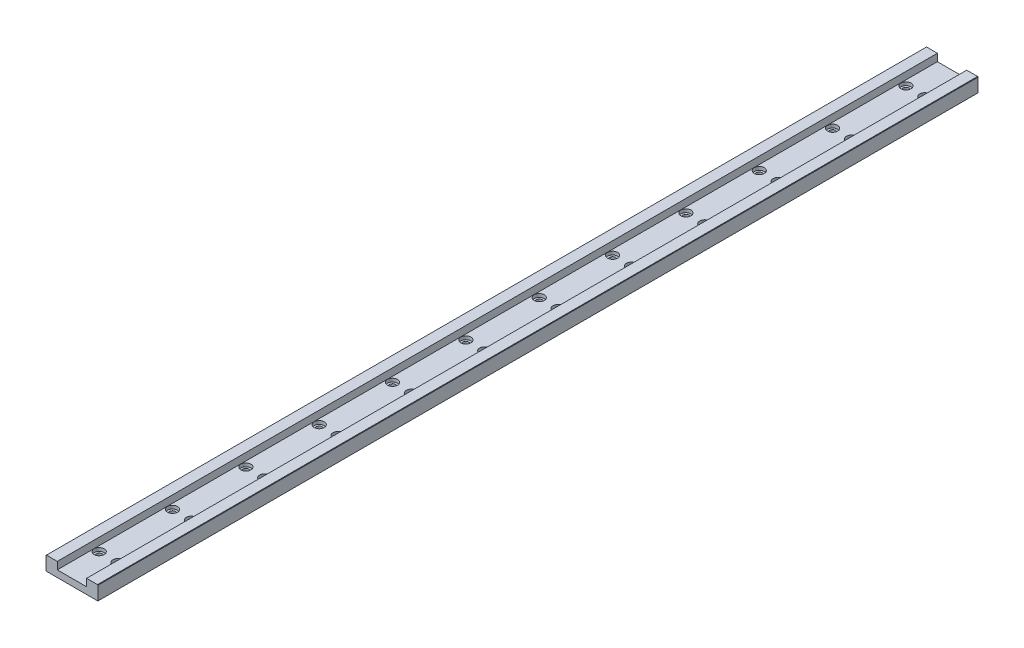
from build123d import *

# Parameters (mm, degrees)
EXTRUDE1_DEPTH                   = 210
EXTRUDE1_DEPTH_BACK              = 210
CBORE_FOR_M2_5_SHCS1_D           = 2.9
CBORE_FOR_M2_5_SHCS1_CBORE_D     = 4.8
CBORE_FOR_M2_5_SHCS1_CBORE_DEPTH = 1.6
LPATTERN1_COUNT                  = 6
LPATTERN1_PITCH                  = 35
LPATTERN1_COL_COUNT              = 7
LPATTERN1_COL_PITCH              = 35
MIRROR1_COPY_1_D                 = 2.9
MIRROR1_COPY_1_CBORE_D           = 4.8
MIRROR1_COPY_1_CBORE_DEPTH       = 1.6
MIRROR1_COPY_2_D                 = 2.9
MIRROR1_COPY_2_CBORE_D           = 4.8
MIRROR1_COPY_2_CBORE_DEPTH       = 1.6
MIRROR1_COPY_3_D                 = 2.9
MIRROR1_COPY_3_CBORE_D           = 4.8
MIRROR1_COPY_3_CBORE_DEPTH       = 1.6
MIRROR1_COPY_4_D                 = 2.9
MIRROR1_COPY_4_CBORE_D           = 4.8
MIRROR1_COPY_4_CBORE_DEPTH       = 1.6
MIRROR1_COPY_5_D                 = 2.9
MIRROR1_COPY_5_CBORE_D           = 4.8
MIRROR1_COPY_5_CBORE_DEPTH       = 1.6
MIRROR1_COPY_6_D                 = 2.9
MIRROR1_COPY_6_CBORE_D           = 4.8
MIRROR1_COPY_6_CBORE_DEPTH       = 1.6
MIRROR1_COPY_7_D                 = 2.9
MIRROR1_COPY_7_CBORE_D           = 4.8
MIRROR1_COPY_7_CBORE_DEPTH       = 1.6
MIRROR1_COPY_8_D                 = 2.9
MIRROR1_COPY_8_CBORE_D           = 4.8
MIRROR1_COPY_8_CBORE_DEPTH       = 1.6
MIRROR1_COPY_9_D                 = 2.9
MIRROR1_COPY_9_CBORE_D           = 4.8
MIRROR1_COPY_9_CBORE_DEPTH       = 1.6
MIRROR1_COPY_10_D                = 2.9
MIRROR1_COPY_10_CBORE_D          = 4.8
MIRROR1_COPY_10_CBORE_DEPTH      = 1.6
MIRROR1_COPY_11_D                = 2.9
MIRROR1_COPY_11_CBORE_D          = 4.8
MIRROR1_COPY_11_CBORE_DEPTH      = 1.6
CHAMFER1_SIZE                    = 0.2


with BuildPart() as part:
    # Sketch1 → Extrude1 (new, two sides: drawn at the far end of the back side and taken through both)
    with BuildSketch(Plane.XY.offset(-EXTRUDE1_DEPTH_BACK)):
        Polygon((-7, 6.7), (-7, 3.2), (7, 3.2), (7, 6.7), (12.37869, 6.7), (12.37869, 0), (-12.37869, 0), (-12.37869, 6.7), align=None)
    extrude(amount=EXTRUDE1_DEPTH + EXTRUDE1_DEPTH_BACK)

    # CBORE for M2.5 SHCS1 (through all)
    with Locations(Plane(origin=(0, 3.2, 0), x_dir=(-1, 0, 0), z_dir=(0, 1, 0))):
        with Locations((4.5, 17.5)):
            cbore_for_m2_5_shcs1 = CounterBoreHole(CBORE_FOR_M2_5_SHCS1_D / 2, CBORE_FOR_M2_5_SHCS1_CBORE_D / 2, CBORE_FOR_M2_5_SHCS1_CBORE_DEPTH)

    # LPattern1: CBORE for M2.5 SHCS1 ×6
    with Locations(*[(0, 0, i * LPATTERN1_PITCH) for i in range(1, LPATTERN1_COUNT)]):
        add(cbore_for_m2_5_shcs1, mode=Mode.SUBTRACT)

    # LPattern1 col: CBORE for M2.5 SHCS1 ×7
    with Locations(*[(0, 0, -i * LPATTERN1_COL_PITCH) for i in range(1, LPATTERN1_COL_COUNT)]):
        add(cbore_for_m2_5_shcs1, mode=Mode.SUBTRACT)

    # Mirror1: CBORE for M2.5 SHCS1 across plane
    add(cbore_for_m2_5_shcs1.mirror(Plane(origin=(0, 0, 0), x_dir=(0, 0, 1), z_dir=(1, 0, 0))), mode=Mode.SUBTRACT)

    # Mirror1 copy 1 (through all)
    with Locations(Plane(origin=(0, 3.2, 35), x_dir=(1, 0, 0), z_dir=(0, 1, 0))):
        with Locations((4.5, -17.5)):
            CounterBoreHole(MIRROR1_COPY_1_D / 2, MIRROR1_COPY_1_CBORE_D / 2, MIRROR1_COPY_1_CBORE_DEPTH)

    # Mirror1 copy 2 (through all)
    with Locations(Plane(origin=(0, 3.2, 70), x_dir=(1, 0, 0), z_dir=(0, 1, 0))):
        with Locations((4.5, -17.5)):
            CounterBoreHole(MIRROR1_COPY_2_D / 2, MIRROR1_COPY_2_CBORE_D / 2, MIRROR1_COPY_2_CBORE_DEPTH)

    # Mirror1 copy 3 (through all)
    with Locations(Plane(origin=(0, 3.2, 105), x_dir=(1, 0, 0), z_dir=(0, 1, 0))):
        with Locations((4.5, -17.5)):
            CounterBoreHole(MIRROR1_COPY_3_D / 2, MIRROR1_COPY_3_CBORE_D / 2, MIRROR1_COPY_3_CBORE_DEPTH)

    # Mirror1 copy 4 (through all)
    with Locations(Plane(origin=(0, 3.2, 140), x_dir=(1, 0, 0), z_dir=(0, 1, 0))):
        with Locations((4.5, -17.5)):
            CounterBoreHole(MIRROR1_COPY_4_D / 2, MIRROR1_COPY_4_CBORE_D / 2, MIRROR1_COPY_4_CBORE_DEPTH)

    # Mirror1 copy 5 (through all)
    with Locations(Plane(origin=(0, 3.2, 175), x_dir=(1, 0, 0), z_dir=(0, 1, 0))):
        with Locations((4.5, -17.5)):
            CounterBoreHole(MIRROR1_COPY_5_D / 2, MIRROR1_COPY_5_CBORE_D / 2, MIRROR1_COPY_5_CBORE_DEPTH)

    # Mirror1 copy 6 (through all)
    with Locations(Plane(origin=(0, 3.2, -35), x_dir=(1, 0, 0), z_dir=(0, 1, 0))):
        with Locations((4.5, -17.5)):
            CounterBoreHole(MIRROR1_COPY_6_D / 2, MIRROR1_COPY_6_CBORE_D / 2, MIRROR1_COPY_6_CBORE_DEPTH)

    # Mirror1 copy 7 (through all)
    with Locations(Plane(origin=(0, 3.2, -70), x_dir=(1, 0, 0), z_dir=(0, 1, 0))):
        with Locations((4.5, -17.5)):
            CounterBoreHole(MIRROR1_COPY_7_D / 2, MIRROR1_COPY_7_CBORE_D / 2, MIRROR1_COPY_7_CBORE_DEPTH)

    # Mirror1 copy 8 (through all)
    with Locations(Plane(origin=(0, 3.2, -105), x_dir=(1, 0, 0), z_dir=(0, 1, 0))):
        with Locations((4.5, -17.5)):
            CounterBoreHole(MIRROR1_COPY_8_D / 2, MIRROR1_COPY_8_CBORE_D / 2, MIRROR1_COPY_8_CBORE_DEPTH)

    # Mirror1 copy 9 (through all)
    with Locations(Plane(origin=(0, 3.2, -140), x_dir=(1, 0, 0), z_dir=(0, 1, 0))):
        with Locations((4.5, -17.5)):
            CounterBoreHole(MIRROR1_COPY_9_D / 2, MIRROR1_COPY_9_CBORE_D / 2, MIRROR1_COPY_9_CBORE_DEPTH)

    # Mirror1 copy 10 (through all)
    with Locations(Plane(origin=(0, 3.2, -175), x_dir=(1, 0, 0), z_dir=(0, 1, 0))):
        with Locations((4.5, -17.5)):
            CounterBoreHole(MIRROR1_COPY_10_D / 2, MIRROR1_COPY_10_CBORE_D / 2, MIRROR1_COPY_10_CBORE_DEPTH)

    # Mirror1 copy 11 (through all)
    with Locations(Plane(origin=(0, 3.2, -210), x_dir=(1, 0, 0), z_dir=(0, 1, 0))):
        with Locations((4.5, -17.5)):
            CounterBoreHole(MIRROR1_COPY_11_D / 2, MIRROR1_COPY_11_CBORE_D / 2, MIRROR1_COPY_11_CBORE_DEPTH)

    # Chamfer1
    chamfer1_edges = [part.edges().sort_by_distance(p)[0] for p in [
        (-12.37869, 6.7, 0),
        (12.37869, 6.7, 0),
    ]]
    chamfer(chamfer1_edges, length=CHAMFER1_SIZE)


solid = part.part
